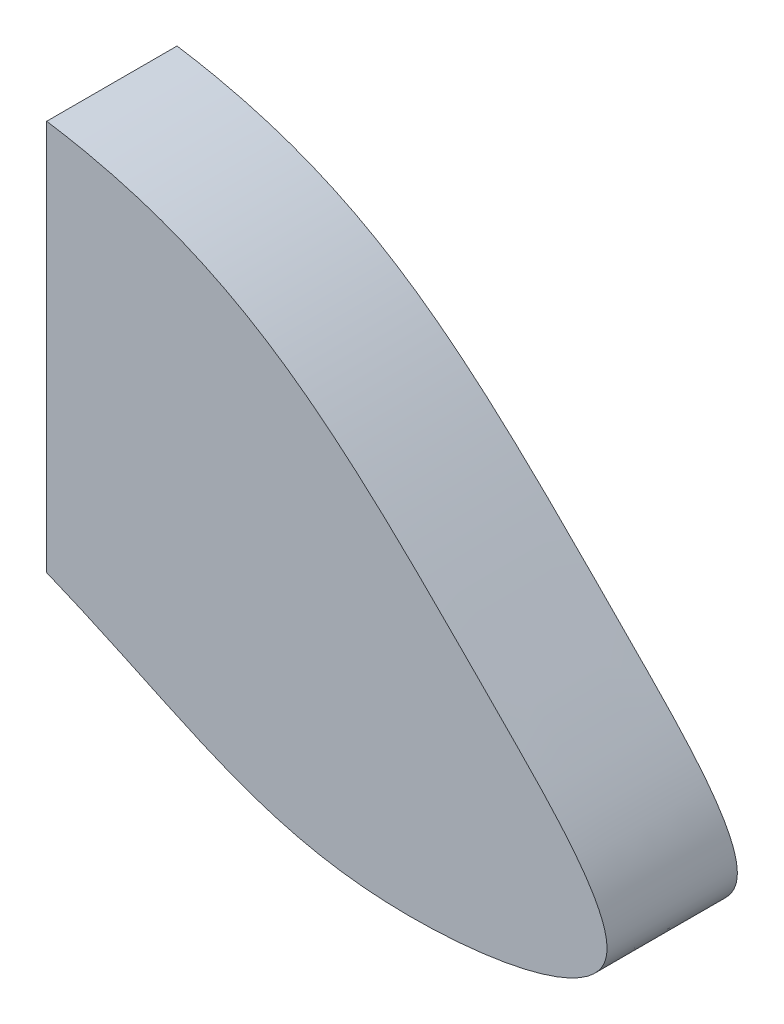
from build123d import *

# Parameters (mm, degrees)
SALIENTE_EXTRUIR1_DEPTH = 6


with BuildPart() as part:
    # Croquis1 → Saliente-Extruir1 (new body)
    with BuildSketch(Plane.XY):
        with BuildLine():
            Line((0, 0), (0, 18))
            add(Edge.make_bspline(
                [(0, 18), (9.402220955, 16.53919033), (15.13800194, 10.444773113), (29.415330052, -3.905310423), (11.543683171, -6.780468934), (6.321068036, -2.566838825), (0, 0)],
                knots=[0, 0, 0, 0, 0.415072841, 0.555975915, 0.712590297, 1, 1, 1, 1], degree=3))
        make_face()
    extrude(amount=SALIENTE_EXTRUIR1_DEPTH)


solid = part.part
